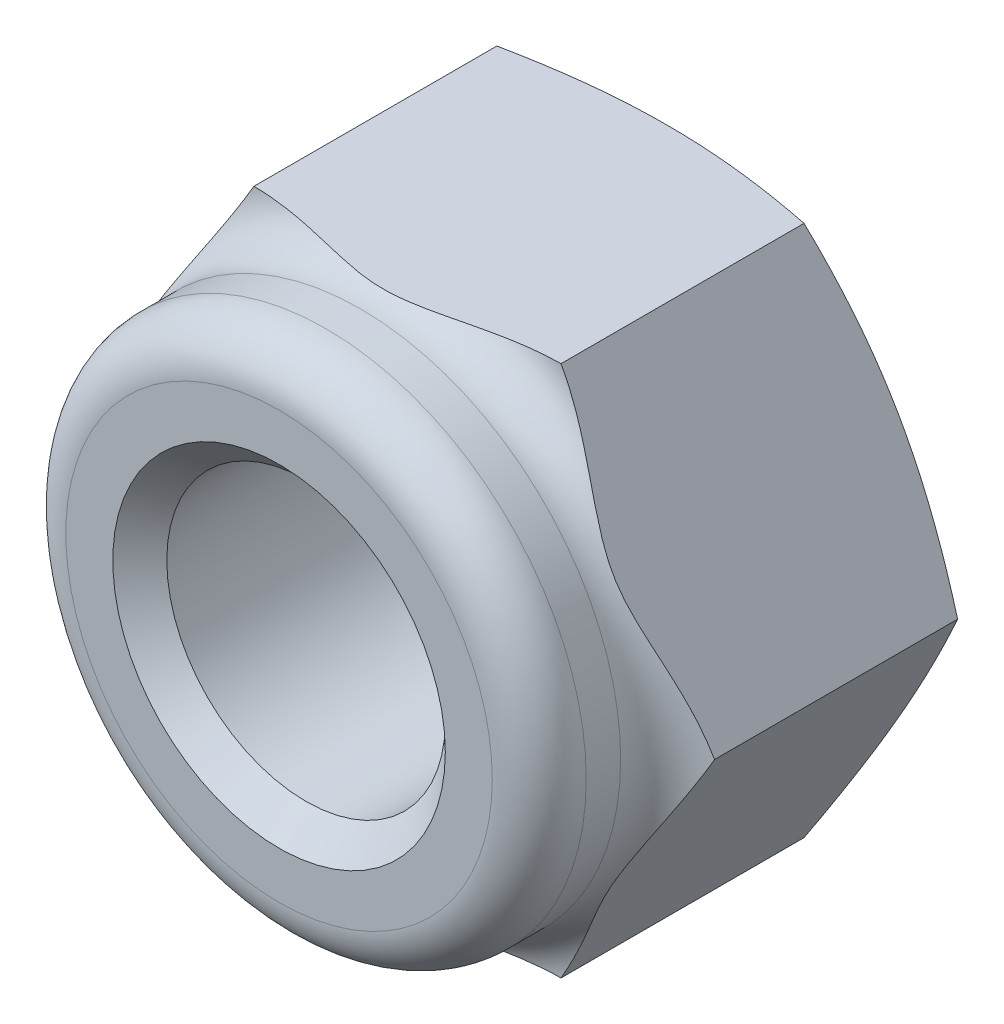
ISO-10303-21;
HEADER;
FILE_DESCRIPTION(('STEP AP214'),'2;1');
FILE_NAME('part.step','',(''),(''),'','','');
FILE_SCHEMA(('AUTOMOTIVE_DESIGN { 1 0 10303 214 1 1 1 1 }'));
ENDSEC;
DATA;
#1=APPLICATION_CONTEXT('core data for automotive mechanical design processes');
#2=APPLICATION_PROTOCOL_DEFINITION('international standard','automotive_design',2000,#1);
#3=PRODUCT_CONTEXT('',#1,'mechanical');
#4=PRODUCT('Part','Part','',(#3));
#5=PRODUCT_RELATED_PRODUCT_CATEGORY('part','',(#4));
#6=PRODUCT_DEFINITION_FORMATION('','',#4);
#7=PRODUCT_DEFINITION_CONTEXT('part definition',#1,'design');
#8=PRODUCT_DEFINITION('design','',#6,#7);
#9=PRODUCT_DEFINITION_SHAPE('','',#8);
#10=(LENGTH_UNIT() NAMED_UNIT(*) SI_UNIT(.MILLI.,.METRE.));
#11=(NAMED_UNIT(*) PLANE_ANGLE_UNIT() SI_UNIT($,.RADIAN.));
#12=(NAMED_UNIT(*) SI_UNIT($,.STERADIAN.) SOLID_ANGLE_UNIT());
#13=UNCERTAINTY_MEASURE_WITH_UNIT(LENGTH_MEASURE(1.E-05),#10,'distance_accuracy_value','');
#14=(GEOMETRIC_REPRESENTATION_CONTEXT(3) GLOBAL_UNCERTAINTY_ASSIGNED_CONTEXT((#13)) GLOBAL_UNIT_ASSIGNED_CONTEXT((#10,
#11,#12)) REPRESENTATION_CONTEXT('',''));
#15=CARTESIAN_POINT('',(0.,0.,0.));
#16=DIRECTION('',(0.,0.,1.));
#17=DIRECTION('',(1.,0.,0.));
#18=AXIS2_PLACEMENT_3D('',#15,#16,#17);
#19=CARTESIAN_POINT('',(0.,0.,9.45253333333));
#20=DIRECTION('',(0.,0.,1.));
#21=DIRECTION('',(0.,-1.,0.));
#22=AXIS2_PLACEMENT_3D('',#19,#20,#21);
#23=TOROIDAL_SURFACE('',#22,9.2376,1.41253333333);
#24=CARTESIAN_POINT('',(0.,0.,9.45253333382));
#25=DIRECTION('',(0.,0.,1.));
#26=DIRECTION('',(0.,-1.,0.));
#27=AXIS2_PLACEMENT_3D('',#24,#25,#26);
#28=CIRCLE('',#27,7.82506666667);
#29=CARTESIAN_POINT('',(0.,-7.82506666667,9.45253333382));
#30=VERTEX_POINT('',#29);
#31=EDGE_CURVE('E98',#30,#30,#28,.T.);
#32=ORIENTED_EDGE('',*,*,#31,.F.);
#33=EDGE_LOOP('',(#32));
#34=FACE_BOUND('',#33,.T.);
#35=CARTESIAN_POINT('',(-4.6187999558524,-7.99999634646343,8.04));
#36=CARTESIAN_POINT('',(-4.67179967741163,-7.90819813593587,8.04001844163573));
#37=CARTESIAN_POINT('',(-4.72477813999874,-7.81643674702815,8.04298143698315));
#38=CARTESIAN_POINT('',(-4.83056814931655,-7.63320307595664,8.05401318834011));
#39=CARTESIAN_POINT('',(-4.88337978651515,-7.54173063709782,8.06207839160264));
#40=CARTESIAN_POINT('',(-4.98833949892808,-7.35993508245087,8.08244681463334));
#41=CARTESIAN_POINT('',(-5.04048940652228,-7.26960879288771,8.09471357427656));
#42=CARTESIAN_POINT('',(-5.14455264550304,-7.08936597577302,8.12284015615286));
#43=CARTESIAN_POINT('',(-5.19646593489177,-6.9994495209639,8.13870059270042));
#44=CARTESIAN_POINT('',(-5.29837831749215,-6.82293209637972,8.17283355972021));
#45=CARTESIAN_POINT('',(-5.34838536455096,-6.73631735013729,8.19101231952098));
#46=CARTESIAN_POINT('',(-5.44818063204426,-6.56346687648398,8.22960775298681));
#47=CARTESIAN_POINT('',(-5.49796885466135,-6.47723114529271,8.25002440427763));
#48=CARTESIAN_POINT('',(-5.59766278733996,-6.30455618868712,8.29267772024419));
#49=CARTESIAN_POINT('',(-5.64756739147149,-6.21811887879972,8.3149246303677));
#50=CARTESIAN_POINT('',(-5.74723889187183,-6.04548277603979,8.36054287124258));
#51=CARTESIAN_POINT('',(-5.79700580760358,-5.95928394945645,8.38391403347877));
#52=CARTESIAN_POINT('',(-5.89158217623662,-5.79547287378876,8.42881094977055));
#53=CARTESIAN_POINT('',(-5.9363970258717,-5.71785127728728,8.45029168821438));
#54=CARTESIAN_POINT('',(-6.02604516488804,-5.56257614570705,8.49309828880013));
#55=CARTESIAN_POINT('',(-6.07087845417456,-5.48492261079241,8.51442415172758));
#56=CARTESIAN_POINT('',(-6.16068318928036,-5.32937624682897,8.55629756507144));
#57=CARTESIAN_POINT('',(-6.20565472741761,-5.25148325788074,8.57684433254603));
#58=CARTESIAN_POINT('',(-6.29577454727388,-5.09539115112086,8.61635815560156));
#59=CARTESIAN_POINT('',(-6.34092283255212,-5.01719202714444,8.63532517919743));
#60=CARTESIAN_POINT('',(-6.430916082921,-4.86131914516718,8.67052512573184));
#61=CARTESIAN_POINT('',(-6.47575799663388,-4.78365067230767,8.68678867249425));
#62=CARTESIAN_POINT('',(-6.56572904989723,-4.62781623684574,8.71582331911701));
#63=CARTESIAN_POINT('',(-6.61085817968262,-4.54965029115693,8.72859453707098));
#64=CARTESIAN_POINT('',(-6.70127512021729,-4.3930435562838,8.74956093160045));
#65=CARTESIAN_POINT('',(-6.74656225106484,-4.31460394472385,8.75776748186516));
#66=CARTESIAN_POINT('',(-6.83729960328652,-4.15744224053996,8.76881704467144));
#67=CARTESIAN_POINT('',(-6.88274980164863,-4.07872018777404,8.7716607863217));
#68=CARTESIAN_POINT('',(-6.97365019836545,-3.92127608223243,8.77166078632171));
#69=CARTESIAN_POINT('',(-7.01910039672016,-3.84255402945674,8.76881704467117));
#70=CARTESIAN_POINT('',(-7.10983774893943,-3.6853923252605,8.75776748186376));
#71=CARTESIAN_POINT('',(-7.15512487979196,-3.60695271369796,8.74956093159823));
#72=CARTESIAN_POINT('',(-7.24554182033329,-3.45034597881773,8.72859453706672));
#73=CARTESIAN_POINT('',(-7.29067095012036,-3.37218003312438,8.71582331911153));
#74=CARTESIAN_POINT('',(-7.38064200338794,-3.21634559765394,8.68678867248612));
#75=CARTESIAN_POINT('',(-7.42548391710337,-3.13867712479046,8.67052512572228));
#76=CARTESIAN_POINT('',(-7.51547716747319,-2.9828042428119,8.63532517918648));
#77=CARTESIAN_POINT('',(-7.56062545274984,-2.9046051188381,8.61635815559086));
#78=CARTESIAN_POINT('',(-7.65074527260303,-2.74851301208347,8.57684433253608));
#79=CARTESIAN_POINT('',(-7.69571681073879,-2.67062002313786,8.55629756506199));
#80=CARTESIAN_POINT('',(-7.78552154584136,-2.51507365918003,8.51442415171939));
#81=CARTESIAN_POINT('',(-7.83035483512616,-2.43742012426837,8.49309828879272));
#82=CARTESIAN_POINT('',(-7.92000297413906,-2.2821449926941,8.45029168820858));
#83=CARTESIAN_POINT('',(-7.96481782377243,-2.20452339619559,8.42881094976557));
#84=CARTESIAN_POINT('',(-8.05939419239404,-2.04071232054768,8.38391403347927));
#85=CARTESIAN_POINT('',(-8.10916110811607,-1.95451349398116,8.36054287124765));
#86=CARTESIAN_POINT('',(-8.20883260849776,-1.78187739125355,8.31492463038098));
#87=CARTESIAN_POINT('',(-8.25873721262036,-1.69544008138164,8.29267772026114));
#88=CARTESIAN_POINT('',(-8.35843114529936,-1.52276512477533,8.2500244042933));
#89=CARTESIAN_POINT('',(-8.40821936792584,-1.43652939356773,8.22960775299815));
#90=CARTESIAN_POINT('',(-8.50801463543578,-1.26367891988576,8.19101231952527));
#91=CARTESIAN_POINT('',(-8.55802168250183,-1.17706417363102,8.17283355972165));
#92=CARTESIAN_POINT('',(-8.65993405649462,-1.00054676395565,8.13870059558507));
#93=CARTESIAN_POINT('',(-8.71184733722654,-0.910630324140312,8.12284016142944));
#94=CARTESIAN_POINT('',(-8.81591055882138,-0.730387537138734,8.09471358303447));
#95=CARTESIAN_POINT('',(-8.86806045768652,-0.640061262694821,8.08244682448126));
#96=CARTESIAN_POINT('',(-8.9730201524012,-0.45826573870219,8.06207840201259));
#97=CARTESIAN_POINT('',(-9.02583178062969,-0.366793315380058,8.05401319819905));
#98=CARTESIAN_POINT('',(-9.13162177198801,-0.183559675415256,8.04298144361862));
#99=CARTESIAN_POINT('',(-9.18460022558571,-0.0917983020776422,8.04001844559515));
#100=CARTESIAN_POINT('',(-9.23759993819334,-1.0705474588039E-07,8.04));
#101=B_SPLINE_CURVE_WITH_KNOTS('',3,(#35,#36,#37,#38,#39,#40,#41,#42,#43,#44,#45,#46,#47,#48,
#49,#50,#51,#52,#53,#54,#55,#56,#57,#58,#59,#60,#61,#62,#63,#64,#65,#66,#67,#68,#69,#70,#71,#72,
#73,#74,#75,#76,#77,#78,#79,#80,#81,#82,#83,#84,#85,#86,#87,#88,#89,#90,#91,#92,#93,#94,#95,#96,
#97,#98,#99,#100),.UNSPECIFIED.,.F.,.F.,(4,2,2,2,2,2,2,2,2,2,2,2,2,2,2,2,2,2,2,2,2,2,2,2,2,2,2,
2,2,2,2,2,4),(0.,0.31789681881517,0.635572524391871,0.950558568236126,1.2655984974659,
1.57052567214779,1.87544979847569,2.18221516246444,2.48893468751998,2.76543839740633,
3.04194070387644,3.31871388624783,3.59549267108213,3.8688836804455,4.14226544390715,
4.4149629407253,4.68762335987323,4.96028377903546,5.23298127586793,5.50636303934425,
5.77975404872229,6.05653283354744,6.33330601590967,6.60980832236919,6.88631203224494,
7.19303155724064,7.49979692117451,7.8047210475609,8.10964822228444,8.42468809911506,
8.73967409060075,9.05734974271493,9.37524650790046),.UNSPECIFIED.);
#102=CARTESIAN_POINT('',(-4.61879991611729,-7.99999630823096,8.04));
#103=VERTEX_POINT('',#102);
#104=CARTESIAN_POINT('',(-9.23759999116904,-9.17566124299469E-08,8.04));
#105=VERTEX_POINT('',#104);
#106=EDGE_CURVE('E85',#103,#105,#101,.T.);
#107=ORIENTED_EDGE('',*,*,#106,.F.);
#108=CARTESIAN_POINT('',(4.61880008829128,-7.99999627,8.04));
#109=CARTESIAN_POINT('',(4.51280064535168,-7.99999626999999,8.04001844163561));
#110=CARTESIAN_POINT('',(4.40684372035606,-7.99999627,8.04298143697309));
#111=CARTESIAN_POINT('',(4.19526370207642,-7.99999627,8.05401318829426));
#112=CARTESIAN_POINT('',(4.08964042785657,-7.99999627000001,8.06207839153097));
#113=CARTESIAN_POINT('',(3.87972100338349,-7.99999626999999,8.08244681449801));
#114=CARTESIAN_POINT('',(3.77542118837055,-7.99999626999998,8.09471357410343));
#115=CARTESIAN_POINT('',(3.56729471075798,-7.99999627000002,8.12284015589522));
#116=CARTESIAN_POINT('',(3.46346813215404,-7.99999627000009,8.13870059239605));
#117=CARTESIAN_POINT('',(3.25964336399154,-7.99999627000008,8.17283355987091));
#118=CARTESIAN_POINT('',(3.15962926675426,-7.99999627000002,8.19101232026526));
#119=CARTESIAN_POINT('',(2.96003872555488,-7.99999626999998,8.22960775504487));
#120=CARTESIAN_POINT('',(2.86046227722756,-7.99999627,8.25002440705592));
#121=CARTESIAN_POINT('',(2.66107440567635,-7.99999627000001,8.29267772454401));
#122=CARTESIAN_POINT('',(2.56126519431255,-7.99999627,8.31492463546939));
#123=CARTESIAN_POINT('',(2.36192218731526,-7.99999627,8.36054287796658));
#124=CARTESIAN_POINT('',(2.26238835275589,-7.99999627,8.38391404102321));
#125=CARTESIAN_POINT('',(2.07323561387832,-7.99999627,8.4288109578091));
#126=CARTESIAN_POINT('',(1.98360591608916,-7.99999627,8.45029169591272));
#127=CARTESIAN_POINT('',(1.80430964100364,-7.99999627,8.49309829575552));
#128=CARTESIAN_POINT('',(1.71464306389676,-7.99999627,8.51442415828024));
#129=CARTESIAN_POINT('',(1.53503359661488,-7.99999627,8.55629757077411));
#130=CARTESIAN_POINT('',(1.44509052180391,-7.99999627,8.57684433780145));
#131=CARTESIAN_POINT('',(1.2648508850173,-7.99999627,8.61635815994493));
#132=CARTESIAN_POINT('',(1.1745543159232,-7.99999627,8.63532518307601));
#133=CARTESIAN_POINT('',(0.994567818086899,-7.99999627,8.67052512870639));
#134=CARTESIAN_POINT('',(0.904883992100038,-7.99999627,8.68678867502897));
#135=CARTESIAN_POINT('',(0.724941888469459,-7.99999627,8.71582332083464));
#136=CARTESIAN_POINT('',(0.634683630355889,-7.99999627,8.72859453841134));
#137=CARTESIAN_POINT('',(0.453849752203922,-7.99999627,8.7495609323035));
#138=CARTESIAN_POINT('',(0.363275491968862,-7.99999627,8.75776748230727));
#139=CARTESIAN_POINT('',(0.181800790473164,-7.99999627,8.76881704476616));
#140=CARTESIAN_POINT('',(0.0909003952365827,-7.99999627,8.77166078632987));
#141=CARTESIAN_POINT('',(-0.0909003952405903,-7.99999627,8.77166078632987));
#142=CARTESIAN_POINT('',(-0.181800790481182,-7.99999627,8.76881704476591));
#143=CARTESIAN_POINT('',(-0.363275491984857,-7.99999627,8.75776748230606));
#144=CARTESIAN_POINT('',(-0.453849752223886,-7.99999627,8.74956093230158));
#145=CARTESIAN_POINT('',(-0.634683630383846,-7.99999627,8.72859453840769));
#146=CARTESIAN_POINT('',(-0.724941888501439,-7.99999627,8.71582332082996));
#147=CARTESIAN_POINT('',(-0.904883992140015,-7.99999627,8.68678867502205));
#148=CARTESIAN_POINT('',(-0.994567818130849,-7.99999627,8.67052512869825));
#149=CARTESIAN_POINT('',(-1.17455431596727,-7.99999627,8.63532518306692));
#150=CARTESIAN_POINT('',(-1.26485088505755,-7.99999627,8.61635815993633));
#151=CARTESIAN_POINT('',(-1.44509052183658,-7.99999627,8.57684433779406));
#152=CARTESIAN_POINT('',(-1.53503359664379,-7.99999627,8.55629757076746));
#153=CARTESIAN_POINT('',(-1.71464306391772,-7.99999627,8.51442415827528));
#154=CARTESIAN_POINT('',(-1.8043096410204,-7.99999627,8.49309829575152));
#155=CARTESIAN_POINT('',(-1.98360591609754,-7.99999627,8.45029169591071));
#156=CARTESIAN_POINT('',(-2.07323561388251,-7.99999627,8.42881095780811));
#157=CARTESIAN_POINT('',(-2.26238835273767,-7.99999627,8.38391404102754));
#158=CARTESIAN_POINT('',(-2.36192218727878,-7.99999627,8.36054287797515));
#159=CARTESIAN_POINT('',(-2.56126519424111,-7.99999627,8.31492463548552));
#160=CARTESIAN_POINT('',(-2.66107440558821,-7.99999627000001,8.29267772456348));
#161=CARTESIAN_POINT('',(-2.86046227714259,-7.99999627,8.25002440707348));
#162=CARTESIAN_POINT('',(-2.96003872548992,-7.99999626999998,8.22960775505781));
#163=CARTESIAN_POINT('',(-3.15962926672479,-7.99999627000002,8.19101232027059));
#164=CARTESIAN_POINT('',(-3.25964336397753,-7.99999627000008,8.17283355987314));
#165=CARTESIAN_POINT('',(-3.46346811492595,-7.99999627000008,8.13870059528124));
#166=CARTESIAN_POINT('',(-3.5672946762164,-7.99999627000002,8.12284016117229));
#167=CARTESIAN_POINT('',(-3.77542111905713,-7.99999626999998,8.09471358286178));
#168=CARTESIAN_POINT('',(-3.87972091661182,-7.99999627,8.08244682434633));
#169=CARTESIAN_POINT('',(-4.08964030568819,-7.99999627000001,8.06207840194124));
#170=CARTESIAN_POINT('',(-4.19526356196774,-7.99999627,8.05401319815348));
#171=CARTESIAN_POINT('',(-4.40684354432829,-7.99999627,8.0429814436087));
#172=CARTESIAN_POINT('',(-4.51280045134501,-7.99999627,8.04001844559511));
#173=CARTESIAN_POINT('',(-4.61879987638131,-7.99999627,8.04));
#174=B_SPLINE_CURVE_WITH_KNOTS('',3,(#108,#109,#110,#111,#112,#113,#114,#115,#116,#117,#118,
#119,#120,#121,#122,#123,#124,#125,#126,#127,#128,#129,#130,#131,#132,#133,#134,#135,#136,#137,
#138,#139,#140,#141,#142,#143,#144,#145,#146,#147,#148,#149,#150,#151,#152,#153,#154,#155,#156,
#157,#158,#159,#160,#161,#162,#163,#164,#165,#166,#167,#168,#169,#170,#171,#172,#173),
.UNSPECIFIED.,.F.,.F.,(4,2,2,2,2,2,2,2,2,2,2,2,2,2,2,2,2,2,2,2,2,2,2,2,2,2,2,2,2,2,2,2,4),(0.,
0.317896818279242,0.635572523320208,0.950558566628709,1.2655984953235,1.57052567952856,
1.87544981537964,2.18221518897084,2.48893472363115,2.76543842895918,3.0419407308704,
3.31871390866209,3.59549268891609,3.86888369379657,4.14226545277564,4.41496294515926,
4.687623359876,4.96028377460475,5.23298126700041,5.50636302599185,5.77975403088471,
6.05653281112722,6.33330598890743,6.60980829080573,6.88631199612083,7.19303153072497,
7.49979690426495,7.80472104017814,8.10964822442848,8.4246881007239,8.73967409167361,
9.05734974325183,9.37524650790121),.UNSPECIFIED.);
#175=CARTESIAN_POINT('',(4.61880007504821,-7.99999621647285,8.04));
#176=VERTEX_POINT('',#175);
#177=EDGE_CURVE('E79',#176,#103,#174,.T.);
#178=ORIENTED_EDGE('',*,*,#177,.F.);
#179=CARTESIAN_POINT('',(9.23760004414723,7.64627748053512E-08,8.04));
#180=CARTESIAN_POINT('',(9.18460032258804,-0.0917981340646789,8.0400184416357));
#181=CARTESIAN_POINT('',(9.13162186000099,-0.183559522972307,8.04298143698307));
#182=CARTESIAN_POINT('',(9.0258318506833,-0.366793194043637,8.05401318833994));
#183=CARTESIAN_POINT('',(8.97302021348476,-0.458265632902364,8.06207839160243));
#184=CARTESIAN_POINT('',(8.86806050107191,-0.64006118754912,8.08244681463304));
#185=CARTESIAN_POINT('',(8.81591059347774,-0.730387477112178,8.09471357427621));
#186=CARTESIAN_POINT('',(8.71184735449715,-0.910630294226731,8.12284015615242));
#187=CARTESIAN_POINT('',(8.65993406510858,-1.00054674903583,8.13870059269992));
#188=CARTESIAN_POINT('',(8.55802168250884,-1.17706417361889,8.17283355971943));
#189=CARTESIAN_POINT('',(8.50801463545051,-1.26367891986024,8.19101231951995));
#190=CARTESIAN_POINT('',(8.40821936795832,-1.43652939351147,8.22960775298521));
#191=CARTESIAN_POINT('',(8.35843114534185,-1.52276512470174,8.25002440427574));
#192=CARTESIAN_POINT('',(8.25873721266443,-1.6954400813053,8.29267772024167));
#193=CARTESIAN_POINT('',(8.20883260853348,-1.78187739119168,8.31492463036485));
#194=CARTESIAN_POINT('',(8.10916110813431,-1.95451349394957,8.36054287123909));
#195=CARTESIAN_POINT('',(8.05939419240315,-2.04071232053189,8.38391403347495));
#196=CARTESIAN_POINT('',(7.96481782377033,-2.20452339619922,8.42881094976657));
#197=CARTESIAN_POINT('',(7.92000297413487,-2.28214499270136,8.45029168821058));
#198=CARTESIAN_POINT('',(7.83035483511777,-2.43742012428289,8.49309828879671));
#199=CARTESIAN_POINT('',(7.78552154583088,-2.51507365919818,8.51442415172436));
#200=CARTESIAN_POINT('',(7.69571681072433,-2.6706200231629,8.55629756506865));
#201=CARTESIAN_POINT('',(7.65074527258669,-2.74851301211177,8.57684433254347));
#202=CARTESIAN_POINT('',(7.56062545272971,-2.90460511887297,8.61635815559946));
#203=CARTESIAN_POINT('',(7.51547716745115,-2.98280424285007,8.63532517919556));
#204=CARTESIAN_POINT('',(7.42548391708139,-3.13867712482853,8.67052512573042));
#205=CARTESIAN_POINT('',(7.38064200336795,-3.21634559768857,8.68678867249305));
#206=CARTESIAN_POINT('',(7.29067095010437,-3.37218003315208,8.71582331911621));
#207=CARTESIAN_POINT('',(7.24554182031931,-3.45034597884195,8.72859453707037));
#208=CARTESIAN_POINT('',(7.15512487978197,-3.60695271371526,8.74956093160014));
#209=CARTESIAN_POINT('',(7.10983774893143,-3.68539232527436,8.75776748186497));
#210=CARTESIAN_POINT('',(7.01910039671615,-3.84255402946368,8.76881704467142));
#211=CARTESIAN_POINT('',(6.97365019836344,-3.9212760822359,8.77166078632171));
#212=CARTESIAN_POINT('',(6.88274980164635,-4.07872018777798,8.7716607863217));
#213=CARTESIAN_POINT('',(6.83729960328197,-4.15744224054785,8.76881704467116));
#214=CARTESIAN_POINT('',(6.74656225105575,-4.31460394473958,8.75776748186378));
#215=CARTESIAN_POINT('',(6.70127512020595,-4.39304355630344,8.74956093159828));
#216=CARTESIAN_POINT('',(6.61085817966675,-4.54965029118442,8.72859453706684));
#217=CARTESIAN_POINT('',(6.56572904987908,-4.62781623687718,8.71582331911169));
#218=CARTESIAN_POINT('',(6.4757579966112,-4.78365067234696,8.68678867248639));
#219=CARTESIAN_POINT('',(6.43091608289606,-4.86131914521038,8.6705251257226));
#220=CARTESIAN_POINT('',(6.34092283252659,-5.01719202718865,8.63532517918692));
#221=CARTESIAN_POINT('',(6.29577454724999,-5.09539115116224,8.61635815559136));
#222=CARTESIAN_POINT('',(6.20565472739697,-5.25148325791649,8.57684433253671));
#223=CARTESIAN_POINT('',(6.16068318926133,-5.32937624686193,8.55629756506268));
#224=CARTESIAN_POINT('',(6.07087845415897,-5.4849226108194,8.5144241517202));
#225=CARTESIAN_POINT('',(6.02604516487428,-5.56257614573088,8.49309828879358));
#226=CARTESIAN_POINT('',(5.93639702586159,-5.71785127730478,8.45029168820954));
#227=CARTESIAN_POINT('',(5.89158217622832,-5.79547287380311,8.42881094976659));
#228=CARTESIAN_POINT('',(5.79700580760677,-5.95928394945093,8.3839140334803));
#229=CARTESIAN_POINT('',(5.74723889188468,-6.04548277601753,8.36054287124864));
#230=CARTESIAN_POINT('',(5.6475673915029,-6.21811887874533,8.3149246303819));
#231=CARTESIAN_POINT('',(5.59766278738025,-6.30455618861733,8.29267772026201));
#232=CARTESIAN_POINT('',(5.49796885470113,-6.4772311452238,8.25002440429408));
#233=CARTESIAN_POINT('',(5.44818063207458,-6.56346687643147,8.22960775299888));
#234=CARTESIAN_POINT('',(5.34838536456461,-6.73631735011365,8.19101231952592));
#235=CARTESIAN_POINT('',(5.29837831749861,-6.82293209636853,8.17283355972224));
#236=CARTESIAN_POINT('',(5.19646594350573,-6.99944950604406,8.13870059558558));
#237=CARTESIAN_POINT('',(5.14455266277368,-7.08936594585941,8.12284016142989));
#238=CARTESIAN_POINT('',(5.04048944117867,-7.26960873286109,8.09471358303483));
#239=CARTESIAN_POINT('',(4.98833954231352,-7.35993500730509,8.08244682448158));
#240=CARTESIAN_POINT('',(4.88337984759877,-7.54173053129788,8.06207840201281));
#241=CARTESIAN_POINT('',(4.83056821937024,-7.63320295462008,8.05401319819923));
#242=CARTESIAN_POINT('',(4.72477822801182,-7.81643659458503,8.0429814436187));
#243=CARTESIAN_POINT('',(4.67179977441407,-7.90819796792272,8.04001844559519));
#244=CARTESIAN_POINT('',(4.61880006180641,-7.9999961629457,8.04));
#245=B_SPLINE_CURVE_WITH_KNOTS('',3,(#179,#180,#181,#182,#183,#184,#185,#186,#187,#188,#189,
#190,#191,#192,#193,#194,#195,#196,#197,#198,#199,#200,#201,#202,#203,#204,#205,#206,#207,#208,
#209,#210,#211,#212,#213,#214,#215,#216,#217,#218,#219,#220,#221,#222,#223,#224,#225,#226,#227,
#228,#229,#230,#231,#232,#233,#234,#235,#236,#237,#238,#239,#240,#241,#242,#243,#244),
.UNSPECIFIED.,.F.,.F.,(4,2,2,2,2,2,2,2,2,2,2,2,2,2,2,2,2,2,2,2,2,2,2,2,2,2,2,2,2,2,2,2,4),(0.,
0.317896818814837,0.635572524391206,0.950558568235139,1.26559849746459,1.57052567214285,
1.87544979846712,2.18221516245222,2.48893468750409,2.76543839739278,3.04194070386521,
3.31871388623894,3.59549267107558,3.86888368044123,4.14226544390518,4.41496294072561,
4.68762335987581,4.9602837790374,5.23298127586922,5.5063630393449,5.77975404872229,
6.05653283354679,6.33330601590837,6.60980832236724,6.88631203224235,7.19303155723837,
7.49979692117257,7.80472104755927,8.10964822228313,8.42468809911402,8.73967409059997,
9.05734974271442,9.37524650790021),.UNSPECIFIED.);
#246=CARTESIAN_POINT('',(9.23759998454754,1.03229682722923E-07,8.04));
#247=VERTEX_POINT('',#246);
#248=EDGE_CURVE('E82',#247,#176,#245,.T.);
#249=ORIENTED_EDGE('',*,*,#248,.F.);
#250=CARTESIAN_POINT('',(4.6187999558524,7.99999634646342,8.04));
#251=CARTESIAN_POINT('',(4.67179967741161,7.90819813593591,8.04001844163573));
#252=CARTESIAN_POINT('',(4.7247781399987,7.81643674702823,8.04298143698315));
#253=CARTESIAN_POINT('',(4.83056814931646,7.63320307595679,8.05401318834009));
#254=CARTESIAN_POINT('',(4.88337978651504,7.54173063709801,8.06207839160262));
#255=CARTESIAN_POINT('',(4.98833949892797,7.35993508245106,8.08244681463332));
#256=CARTESIAN_POINT('',(5.04048940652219,7.26960879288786,8.09471357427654));
#257=CARTESIAN_POINT('',(5.144552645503,7.0893659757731,8.12284015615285));
#258=CARTESIAN_POINT('',(5.19646593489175,6.99944952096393,8.13870059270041));
#259=CARTESIAN_POINT('',(5.29837831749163,6.82293209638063,8.17283355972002));
#260=CARTESIAN_POINT('',(5.34838536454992,6.7363173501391,8.1910123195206));
#261=CARTESIAN_POINT('',(5.44818063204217,6.5634668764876,8.22960775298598));
#262=CARTESIAN_POINT('',(5.49796885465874,6.47723114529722,8.25002440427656));
#263=CARTESIAN_POINT('',(5.59766278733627,6.30455618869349,8.29267772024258));
#264=CARTESIAN_POINT('',(5.64756739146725,6.21811887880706,8.3149246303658));
#265=CARTESIAN_POINT('',(5.74723889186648,6.04548277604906,8.36054287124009));
#266=CARTESIAN_POINT('',(5.79700580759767,5.95928394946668,8.38391403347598));
#267=CARTESIAN_POINT('',(5.89158217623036,5.79547287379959,8.42881094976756));
#268=CARTESIAN_POINT('',(5.93639702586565,5.71785127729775,8.45029168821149));
#269=CARTESIAN_POINT('',(6.02604516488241,5.5625761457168,8.49309828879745));
#270=CARTESIAN_POINT('',(6.07087845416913,5.48492261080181,8.51442415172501));
#271=CARTESIAN_POINT('',(6.16068318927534,5.32937624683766,8.55629756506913));
#272=CARTESIAN_POINT('',(6.2056547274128,5.25148325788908,8.57684433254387));
#273=CARTESIAN_POINT('',(6.29577454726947,5.09539115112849,8.61635815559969));
#274=CARTESIAN_POINT('',(6.34092283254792,5.01719202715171,8.63532517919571));
#275=CARTESIAN_POINT('',(6.43091608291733,4.86131914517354,8.67052512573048));
#276=CARTESIAN_POINT('',(6.47575799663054,4.78365067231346,8.68678867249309));
#277=CARTESIAN_POINT('',(6.56572904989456,4.62781623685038,8.71582331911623));
#278=CARTESIAN_POINT('',(6.61085817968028,4.54965029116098,8.72859453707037));
#279=CARTESIAN_POINT('',(6.70127512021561,4.39304355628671,8.74956093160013));
#280=CARTESIAN_POINT('',(6.7465622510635,4.31460394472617,8.75776748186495));
#281=CARTESIAN_POINT('',(6.83729960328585,4.15744224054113,8.7688170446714));
#282=CARTESIAN_POINT('',(6.88274980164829,4.07872018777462,8.7716607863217));
#283=CARTESIAN_POINT('',(6.97365019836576,3.92127608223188,8.77166078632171));
#284=CARTESIAN_POINT('',(7.01910039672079,3.84255402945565,8.76881704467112));
#285=CARTESIAN_POINT('',(7.10983774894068,3.68539232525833,8.75776748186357));
#286=CARTESIAN_POINT('',(7.15512487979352,3.60695271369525,8.74956093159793));
#287=CARTESIAN_POINT('',(7.24554182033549,3.45034597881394,8.72859453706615));
#288=CARTESIAN_POINT('',(7.29067095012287,3.37218003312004,8.71582331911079));
#289=CARTESIAN_POINT('',(7.38064200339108,3.21634559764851,8.68678867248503));
#290=CARTESIAN_POINT('',(7.42548391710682,3.13867712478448,8.670525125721));
#291=CARTESIAN_POINT('',(7.51547716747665,2.98280424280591,8.63532517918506));
#292=CARTESIAN_POINT('',(7.560625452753,2.90460511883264,8.61635815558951));
#293=CARTESIAN_POINT('',(7.65074527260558,2.74851301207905,8.57684433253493));
#294=CARTESIAN_POINT('',(7.69571681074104,2.67062002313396,8.55629756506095));
#295=CARTESIAN_POINT('',(7.78552154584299,2.51507365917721,8.51442415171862));
#296=CARTESIAN_POINT('',(7.83035483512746,2.43742012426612,8.4930982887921));
#297=CARTESIAN_POINT('',(7.92000297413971,2.28214499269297,8.45029168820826));
#298=CARTESIAN_POINT('',(7.96481782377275,2.20452339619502,8.42881094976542));
#299=CARTESIAN_POINT('',(8.05939419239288,2.04071232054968,8.38391403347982));
#300=CARTESIAN_POINT('',(8.10916110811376,1.95451349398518,8.36054287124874));
#301=CARTESIAN_POINT('',(8.20883260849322,1.78187739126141,8.31492463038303));
#302=CARTESIAN_POINT('',(8.25873721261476,1.69544008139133,8.29267772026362));
#303=CARTESIAN_POINT('',(8.35843114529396,1.52276512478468,8.25002440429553));
#304=CARTESIAN_POINT('',(8.40821936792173,1.4365293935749,8.22960775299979));
#305=CARTESIAN_POINT('',(8.50801463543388,1.263678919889,8.19101231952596));
#306=CARTESIAN_POINT('',(8.55802168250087,1.17706417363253,8.17283355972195));
#307=CARTESIAN_POINT('',(8.65993405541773,1.00054676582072,8.13870059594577));
#308=CARTESIAN_POINT('',(8.71184733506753,0.910630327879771,8.12284016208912));
#309=CARTESIAN_POINT('',(8.81591055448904,0.730387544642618,8.09471358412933));
#310=CARTESIAN_POINT('',(8.86806045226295,0.640061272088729,8.08244682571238));
#311=CARTESIAN_POINT('',(8.97302014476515,0.458265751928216,8.06207840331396));
#312=CARTESIAN_POINT('',(9.02583177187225,0.36679333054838,8.05401319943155));
#313=CARTESIAN_POINT('',(9.1316217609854,0.183559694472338,8.04298144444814));
#314=CARTESIAN_POINT('',(9.18460021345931,0.0917983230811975,8.04001844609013));
#315=CARTESIAN_POINT('',(9.23759992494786,1.29996586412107E-07,8.04));
#316=B_SPLINE_CURVE_WITH_KNOTS('',3,(#250,#251,#252,#253,#254,#255,#256,#257,#258,#259,#260,
#261,#262,#263,#264,#265,#266,#267,#268,#269,#270,#271,#272,#273,#274,#275,#276,#277,#278,#279,
#280,#281,#282,#283,#284,#285,#286,#287,#288,#289,#290,#291,#292,#293,#294,#295,#296,#297,#298,
#299,#300,#301,#302,#303,#304,#305,#306,#307,#308,#309,#310,#311,#312,#313,#314,#315),
.UNSPECIFIED.,.F.,.F.,(4,2,2,2,2,2,2,2,2,2,2,2,2,2,2,2,2,2,2,2,2,2,2,2,2,2,2,2,2,2,2,2,4),(0.,
0.317896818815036,0.635572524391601,0.950558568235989,1.2655984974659,1.57052567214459,
1.87544979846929,2.1822151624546,2.48893468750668,2.76543839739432,3.04194070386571,
3.31871388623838,3.59549267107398,3.8688836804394,4.1422654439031,4.41496294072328,
4.68762335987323,4.96028377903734,5.23298127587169,5.50636303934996,5.77975404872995,
6.05653283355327,6.33330601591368,6.60980832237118,6.88631203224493,7.19303155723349,
7.49979692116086,7.80472104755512,8.10964822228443,8.42468809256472,8.73967407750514,
9.05734972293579,9.37524648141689),.UNSPECIFIED.);
#317=CARTESIAN_POINT('',(4.61879991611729,7.99999630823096,8.04));
#318=VERTEX_POINT('',#317);
#319=EDGE_CURVE('E127',#318,#247,#316,.T.);
#320=ORIENTED_EDGE('',*,*,#319,.F.);
#321=CARTESIAN_POINT('',(-4.61880008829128,7.99999627,8.04));
#322=CARTESIAN_POINT('',(-4.51280064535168,7.99999626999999,8.04001844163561));
#323=CARTESIAN_POINT('',(-4.40684372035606,7.99999627,8.04298143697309));
#324=CARTESIAN_POINT('',(-4.19526370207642,7.99999627,8.05401318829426));
#325=CARTESIAN_POINT('',(-4.08964042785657,7.99999627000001,8.06207839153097));
#326=CARTESIAN_POINT('',(-3.87972100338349,7.99999626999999,8.08244681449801));
#327=CARTESIAN_POINT('',(-3.77542118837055,7.99999626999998,8.09471357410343));
#328=CARTESIAN_POINT('',(-3.56729471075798,7.99999627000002,8.12284015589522));
#329=CARTESIAN_POINT('',(-3.46346813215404,7.99999627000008,8.13870059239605));
#330=CARTESIAN_POINT('',(-3.25964336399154,7.99999627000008,8.17283355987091));
#331=CARTESIAN_POINT('',(-3.15962926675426,7.99999627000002,8.19101232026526));
#332=CARTESIAN_POINT('',(-2.96003872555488,7.99999626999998,8.22960775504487));
#333=CARTESIAN_POINT('',(-2.86046227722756,7.99999627,8.25002440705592));
#334=CARTESIAN_POINT('',(-2.66107440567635,7.99999627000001,8.29267772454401));
#335=CARTESIAN_POINT('',(-2.56126519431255,7.99999627,8.31492463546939));
#336=CARTESIAN_POINT('',(-2.36192218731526,7.99999627,8.36054287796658));
#337=CARTESIAN_POINT('',(-2.26238835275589,7.99999627,8.38391404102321));
#338=CARTESIAN_POINT('',(-2.07323561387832,7.99999627,8.4288109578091));
#339=CARTESIAN_POINT('',(-1.98360591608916,7.99999627,8.45029169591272));
#340=CARTESIAN_POINT('',(-1.80430964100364,7.99999627,8.49309829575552));
#341=CARTESIAN_POINT('',(-1.71464306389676,7.99999627,8.51442415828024));
#342=CARTESIAN_POINT('',(-1.53503359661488,7.99999627,8.55629757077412));
#343=CARTESIAN_POINT('',(-1.44509052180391,7.99999627,8.57684433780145));
#344=CARTESIAN_POINT('',(-1.2648508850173,7.99999627,8.61635815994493));
#345=CARTESIAN_POINT('',(-1.1745543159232,7.99999627,8.63532518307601));
#346=CARTESIAN_POINT('',(-0.994567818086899,7.99999627,8.67052512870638));
#347=CARTESIAN_POINT('',(-0.904883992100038,7.99999627,8.68678867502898));
#348=CARTESIAN_POINT('',(-0.724941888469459,7.99999627,8.71582332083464));
#349=CARTESIAN_POINT('',(-0.634683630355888,7.99999627,8.72859453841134));
#350=CARTESIAN_POINT('',(-0.453849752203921,7.99999627,8.7495609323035));
#351=CARTESIAN_POINT('',(-0.363275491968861,7.99999627,8.75776748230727));
#352=CARTESIAN_POINT('',(-0.181800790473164,7.99999627,8.76881704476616));
#353=CARTESIAN_POINT('',(-0.0909003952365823,7.99999627,8.77166078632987));
#354=CARTESIAN_POINT('',(0.0909003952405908,7.99999627,8.77166078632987));
#355=CARTESIAN_POINT('',(0.181800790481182,7.99999627,8.76881704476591));
#356=CARTESIAN_POINT('',(0.363275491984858,7.99999627,8.75776748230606));
#357=CARTESIAN_POINT('',(0.453849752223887,7.99999627,8.74956093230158));
#358=CARTESIAN_POINT('',(0.634683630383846,7.99999627,8.72859453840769));
#359=CARTESIAN_POINT('',(0.724941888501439,7.99999627,8.71582332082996));
#360=CARTESIAN_POINT('',(0.904883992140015,7.99999627,8.68678867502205));
#361=CARTESIAN_POINT('',(0.994567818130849,7.99999627,8.67052512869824));
#362=CARTESIAN_POINT('',(1.17455431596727,7.99999627,8.63532518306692));
#363=CARTESIAN_POINT('',(1.26485088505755,7.99999627,8.61635815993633));
#364=CARTESIAN_POINT('',(1.44509052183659,7.99999627,8.57684433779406));
#365=CARTESIAN_POINT('',(1.53503359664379,7.99999627,8.55629757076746));
#366=CARTESIAN_POINT('',(1.71464306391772,7.99999627,8.51442415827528));
#367=CARTESIAN_POINT('',(1.8043096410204,7.99999627,8.49309829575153));
#368=CARTESIAN_POINT('',(1.98360591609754,7.99999627,8.45029169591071));
#369=CARTESIAN_POINT('',(2.07323561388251,7.99999627,8.42881095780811));
#370=CARTESIAN_POINT('',(2.26238835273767,7.99999627,8.38391404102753));
#371=CARTESIAN_POINT('',(2.36192218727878,7.99999627,8.36054287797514));
#372=CARTESIAN_POINT('',(2.56126519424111,7.99999627,8.31492463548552));
#373=CARTESIAN_POINT('',(2.66107440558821,7.99999627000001,8.29267772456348));
#374=CARTESIAN_POINT('',(2.8604622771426,7.99999627,8.25002440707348));
#375=CARTESIAN_POINT('',(2.96003872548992,7.99999626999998,8.22960775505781));
#376=CARTESIAN_POINT('',(3.15962926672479,7.99999627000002,8.19101232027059));
#377=CARTESIAN_POINT('',(3.25964336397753,7.99999627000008,8.17283355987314));
#378=CARTESIAN_POINT('',(3.46346811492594,7.99999627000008,8.13870059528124));
#379=CARTESIAN_POINT('',(3.56729467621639,7.99999627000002,8.12284016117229));
#380=CARTESIAN_POINT('',(3.77542111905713,7.99999626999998,8.09471358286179));
#381=CARTESIAN_POINT('',(3.87972091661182,7.99999626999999,8.08244682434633));
#382=CARTESIAN_POINT('',(4.08964030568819,7.99999627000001,8.06207840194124));
#383=CARTESIAN_POINT('',(4.19526356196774,7.99999627,8.05401319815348));
#384=CARTESIAN_POINT('',(4.40684354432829,7.99999627,8.0429814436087));
#385=CARTESIAN_POINT('',(4.51280045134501,7.99999626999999,8.04001844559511));
#386=CARTESIAN_POINT('',(4.61879987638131,7.99999627,8.04));
#387=B_SPLINE_CURVE_WITH_KNOTS('',3,(#321,#322,#323,#324,#325,#326,#327,#328,#329,#330,#331,
#332,#333,#334,#335,#336,#337,#338,#339,#340,#341,#342,#343,#344,#345,#346,#347,#348,#349,#350,
#351,#352,#353,#354,#355,#356,#357,#358,#359,#360,#361,#362,#363,#364,#365,#366,#367,#368,#369,
#370,#371,#372,#373,#374,#375,#376,#377,#378,#379,#380,#381,#382,#383,#384,#385,#386),
.UNSPECIFIED.,.F.,.F.,(4,2,2,2,2,2,2,2,2,2,2,2,2,2,2,2,2,2,2,2,2,2,2,2,2,2,2,2,2,2,2,2,4),(0.,
0.317896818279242,0.635572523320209,0.950558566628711,1.2655984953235,1.57052567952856,
1.87544981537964,2.18221518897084,2.48893472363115,2.76543842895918,3.0419407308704,
3.31871390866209,3.59549268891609,3.86888369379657,4.14226545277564,4.41496294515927,
4.687623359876,4.96028377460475,5.23298126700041,5.50636302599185,5.77975403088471,
6.05653281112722,6.33330598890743,6.60980829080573,6.88631199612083,7.19303153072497,
7.49979690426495,7.80472104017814,8.10964822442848,8.4246881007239,8.73967409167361,
9.05734974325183,9.37524650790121),.UNSPECIFIED.);
#388=CARTESIAN_POINT('',(-4.61880007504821,7.99999621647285,8.04));
#389=VERTEX_POINT('',#388);
#390=EDGE_CURVE('E135',#389,#318,#387,.T.);
#391=ORIENTED_EDGE('',*,*,#390,.F.);
#392=CARTESIAN_POINT('',(-9.23760004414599,-7.64606244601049E-08,8.04));
#393=CARTESIAN_POINT('',(-9.1846003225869,0.0917981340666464,8.04001844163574));
#394=CARTESIAN_POINT('',(-9.13162185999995,0.183559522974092,8.04298143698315));
#395=CARTESIAN_POINT('',(-9.02583185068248,0.366793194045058,8.05401318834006));
#396=CARTESIAN_POINT('',(-8.97302021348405,0.458265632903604,8.06207839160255));
#397=CARTESIAN_POINT('',(-8.8680605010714,0.64006118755,8.08244681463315));
#398=CARTESIAN_POINT('',(-8.81591059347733,0.730387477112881,8.09471357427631));
#399=CARTESIAN_POINT('',(-8.71184735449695,0.91063029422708,8.12284015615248));
#400=CARTESIAN_POINT('',(-8.65993406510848,1.00054674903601,8.13870059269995));
#401=CARTESIAN_POINT('',(-8.55802168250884,1.17706417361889,8.17283355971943));
#402=CARTESIAN_POINT('',(-8.50801463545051,1.26367891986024,8.19101231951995));
#403=CARTESIAN_POINT('',(-8.40821936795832,1.43652939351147,8.22960775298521));
#404=CARTESIAN_POINT('',(-8.35843114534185,1.52276512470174,8.25002440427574));
#405=CARTESIAN_POINT('',(-8.25873721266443,1.69544008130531,8.29267772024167));
#406=CARTESIAN_POINT('',(-8.20883260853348,1.78187739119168,8.31492463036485));
#407=CARTESIAN_POINT('',(-8.10916110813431,1.95451349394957,8.36054287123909));
#408=CARTESIAN_POINT('',(-8.05939419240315,2.04071232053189,8.38391403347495));
#409=CARTESIAN_POINT('',(-7.96481782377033,2.20452339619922,8.42881094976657));
#410=CARTESIAN_POINT('',(-7.92000297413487,2.28214499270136,8.45029168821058));
#411=CARTESIAN_POINT('',(-7.83035483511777,2.43742012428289,8.49309828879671));
#412=CARTESIAN_POINT('',(-7.78552154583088,2.51507365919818,8.51442415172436));
#413=CARTESIAN_POINT('',(-7.69571681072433,2.6706200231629,8.55629756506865));
#414=CARTESIAN_POINT('',(-7.65074527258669,2.74851301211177,8.57684433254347));
#415=CARTESIAN_POINT('',(-7.56062545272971,2.90460511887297,8.61635815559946));
#416=CARTESIAN_POINT('',(-7.51547716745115,2.98280424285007,8.63532517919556));
#417=CARTESIAN_POINT('',(-7.42548391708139,3.13867712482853,8.67052512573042));
#418=CARTESIAN_POINT('',(-7.38064200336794,3.21634559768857,8.68678867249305));
#419=CARTESIAN_POINT('',(-7.29067095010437,3.37218003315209,8.71582331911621));
#420=CARTESIAN_POINT('',(-7.24554182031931,3.45034597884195,8.72859453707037));
#421=CARTESIAN_POINT('',(-7.15512487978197,3.60695271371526,8.74956093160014));
#422=CARTESIAN_POINT('',(-7.10983774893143,3.68539232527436,8.75776748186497));
#423=CARTESIAN_POINT('',(-7.01910039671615,3.84255402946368,8.76881704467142));
#424=CARTESIAN_POINT('',(-6.97365019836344,3.9212760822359,8.77166078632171));
#425=CARTESIAN_POINT('',(-6.88274980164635,4.07872018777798,8.7716607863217));
#426=CARTESIAN_POINT('',(-6.83729960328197,4.15744224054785,8.76881704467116));
#427=CARTESIAN_POINT('',(-6.74656225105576,4.31460394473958,8.75776748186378));
#428=CARTESIAN_POINT('',(-6.70127512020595,4.39304355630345,8.74956093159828));
#429=CARTESIAN_POINT('',(-6.61085817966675,4.54965029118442,8.72859453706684));
#430=CARTESIAN_POINT('',(-6.56572904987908,4.62781623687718,8.71582331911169));
#431=CARTESIAN_POINT('',(-6.4757579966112,4.78365067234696,8.68678867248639));
#432=CARTESIAN_POINT('',(-6.43091608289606,4.86131914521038,8.67052512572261));
#433=CARTESIAN_POINT('',(-6.34092283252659,5.01719202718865,8.63532517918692));
#434=CARTESIAN_POINT('',(-6.29577454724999,5.09539115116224,8.61635815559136));
#435=CARTESIAN_POINT('',(-6.20565472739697,5.25148325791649,8.57684433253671));
#436=CARTESIAN_POINT('',(-6.16068318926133,5.32937624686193,8.55629756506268));
#437=CARTESIAN_POINT('',(-6.07087845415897,5.4849226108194,8.5144241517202));
#438=CARTESIAN_POINT('',(-6.02604516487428,5.56257614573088,8.49309828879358));
#439=CARTESIAN_POINT('',(-5.93639702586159,5.71785127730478,8.45029168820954));
#440=CARTESIAN_POINT('',(-5.89158217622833,5.79547287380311,8.42881094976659));
#441=CARTESIAN_POINT('',(-5.79700580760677,5.95928394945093,8.3839140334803));
#442=CARTESIAN_POINT('',(-5.74723889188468,6.04548277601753,8.36054287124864));
#443=CARTESIAN_POINT('',(-5.6475673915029,6.21811887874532,8.3149246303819));
#444=CARTESIAN_POINT('',(-5.59766278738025,6.30455618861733,8.29267772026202));
#445=CARTESIAN_POINT('',(-5.49796885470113,6.4772311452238,8.25002440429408));
#446=CARTESIAN_POINT('',(-5.44818063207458,6.56346687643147,8.22960775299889));
#447=CARTESIAN_POINT('',(-5.34838536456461,6.73631735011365,8.19101231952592));
#448=CARTESIAN_POINT('',(-5.29837831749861,6.82293209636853,8.17283355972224));
#449=CARTESIAN_POINT('',(-5.19646594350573,6.99944950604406,8.13870059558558));
#450=CARTESIAN_POINT('',(-5.14455266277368,7.08936594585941,8.12284016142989));
#451=CARTESIAN_POINT('',(-5.04048944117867,7.26960873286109,8.09471358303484));
#452=CARTESIAN_POINT('',(-4.98833954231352,7.35993500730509,8.08244682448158));
#453=CARTESIAN_POINT('',(-4.88337984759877,7.54173053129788,8.06207840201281));
#454=CARTESIAN_POINT('',(-4.83056821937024,7.63320295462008,8.05401319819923));
#455=CARTESIAN_POINT('',(-4.72477822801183,7.81643659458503,8.04298144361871));
#456=CARTESIAN_POINT('',(-4.67179977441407,7.90819796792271,8.04001844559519));
#457=CARTESIAN_POINT('',(-4.61880006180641,7.99999616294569,8.04));
#458=B_SPLINE_CURVE_WITH_KNOTS('',3,(#392,#393,#394,#395,#396,#397,#398,#399,#400,#401,#402,
#403,#404,#405,#406,#407,#408,#409,#410,#411,#412,#413,#414,#415,#416,#417,#418,#419,#420,#421,
#422,#423,#424,#425,#426,#427,#428,#429,#430,#431,#432,#433,#434,#435,#436,#437,#438,#439,#440,
#441,#442,#443,#444,#445,#446,#447,#448,#449,#450,#451,#452,#453,#454,#455,#456,#457),
.UNSPECIFIED.,.F.,.F.,(4,2,2,2,2,2,2,2,2,2,2,2,2,2,2,2,2,2,2,2,2,2,2,2,2,2,2,2,2,2,2,2,4),(0.,
0.317896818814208,0.63557252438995,0.950558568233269,1.26559849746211,1.57052567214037,
1.87544979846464,2.18221516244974,2.48893468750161,2.76543839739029,3.04194070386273,
3.31871388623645,3.5954926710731,3.86888368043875,4.1422654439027,4.41496294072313,
4.68762335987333,4.96028377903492,5.23298127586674,5.50636303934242,5.77975404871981,
6.05653283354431,6.33330601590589,6.60980832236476,6.88631203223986,7.19303155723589,
7.49979692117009,7.80472104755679,8.10964822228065,8.42468809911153,8.73967409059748,
9.05734974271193,9.37524650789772),.UNSPECIFIED.);
#459=EDGE_CURVE('E209',#105,#389,#458,.T.);
#460=ORIENTED_EDGE('',*,*,#459,.F.);
#461=EDGE_LOOP('',(#107,#178,#249,#320,#391,#460));
#462=FACE_BOUND('',#461,.T.);
#463=ADVANCED_FACE('F16',(#34,#462),#23,.F.);
#464=CARTESIAN_POINT('',(0.,0.,9.97));
#465=DIRECTION('',(0.,0.,1.));
#466=DIRECTION('',(0.,-1.,0.));
#467=AXIS2_PLACEMENT_3D('',#464,#465,#466);
#468=CYLINDRICAL_SURFACE('',#467,7.82506666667);
#469=ORIENTED_EDGE('',*,*,#31,.T.);
#470=EDGE_LOOP('',(#469));
#471=FACE_BOUND('',#470,.T.);
#472=CARTESIAN_POINT('',(0.,0.,10.4874666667));
#473=DIRECTION('',(0.,0.,1.));
#474=DIRECTION('',(0.,-1.,0.));
#475=AXIS2_PLACEMENT_3D('',#472,#473,#474);
#476=CIRCLE('',#475,7.82506666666);
#477=CARTESIAN_POINT('',(0.,-7.82506666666,10.4874666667));
#478=VERTEX_POINT('',#477);
#479=EDGE_CURVE('E107',#478,#478,#476,.T.);
#480=ORIENTED_EDGE('',*,*,#479,.F.);
#481=EDGE_LOOP('',(#480));
#482=FACE_BOUND('',#481,.T.);
#483=ADVANCED_FACE('F118',(#471,#482),#468,.T.);
#484=CARTESIAN_POINT('',(6.9282,-3.999998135,0.));
#485=DIRECTION('',(0.866025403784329,-0.50000000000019,0.));
#486=DIRECTION('',(0.50000000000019,0.866025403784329,0.));
#487=AXIS2_PLACEMENT_3D('',#484,#485,#486);
#488=PLANE('',#487);
#489=CARTESIAN_POINT('',(9.23760000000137,0.,0.73090909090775));
#490=CARTESIAN_POINT('',(9.0762316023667,-0.27949826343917,0.665708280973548));
#491=CARTESIAN_POINT('',(8.91433059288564,-0.559919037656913,0.605419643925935));
#492=CARTESIAN_POINT('',(8.5894580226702,-1.12261483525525,0.496519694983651));
#493=CARTESIAN_POINT('',(8.42648589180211,-1.40489084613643,0.447915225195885));
#494=CARTESIAN_POINT('',(8.09970305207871,-1.97089532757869,0.364329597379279));
#495=CARTESIAN_POINT('',(7.93589260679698,-2.25462334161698,0.32934439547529));
#496=CARTESIAN_POINT('',(7.60766322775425,-2.8231333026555,0.274618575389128));
#497=CARTESIAN_POINT('',(7.44324443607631,-3.10791500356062,0.254874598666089));
#498=CARTESIAN_POINT('',(7.11690989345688,-3.67314301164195,0.231859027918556));
#499=CARTESIAN_POINT('',(6.95499904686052,-3.95358082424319,0.228313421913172));
#500=CARTESIAN_POINT('',(6.63127303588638,-4.51429072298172,0.2371401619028));
#501=CARTESIAN_POINT('',(6.46945788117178,-4.79456279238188,0.249513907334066));
#502=CARTESIAN_POINT('',(6.14641198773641,-5.35409469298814,0.289514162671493));
#503=CARTESIAN_POINT('',(5.98518094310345,-5.63335505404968,0.317130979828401));
#504=CARTESIAN_POINT('',(5.66348865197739,-6.19054244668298,0.386279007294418));
#505=CARTESIAN_POINT('',(5.50302733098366,-6.46846960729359,0.427808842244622));
#506=CARTESIAN_POINT('',(5.28250879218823,-6.85041892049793,0.49345549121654));
#507=CARTESIAN_POINT('',(5.22204978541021,-6.95513699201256,0.512346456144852));
#508=CARTESIAN_POINT('',(5.10127446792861,-7.16432597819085,0.551773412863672));
#509=CARTESIAN_POINT('',(5.04095813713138,-7.26879692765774,0.572309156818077));
#510=CARTESIAN_POINT('',(4.92025669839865,-7.47785795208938,0.615003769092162));
#511=CARTESIAN_POINT('',(4.85987206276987,-7.58244720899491,0.637167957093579));
#512=CARTESIAN_POINT('',(4.73923509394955,-7.7913965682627,0.682963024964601));
#513=CARTESIAN_POINT('',(4.67898277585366,-7.89575664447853,0.706594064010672));
#514=CARTESIAN_POINT('',(4.61880004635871,-7.9999961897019,0.730909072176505));
#515=B_SPLINE_CURVE_WITH_KNOTS('',3,(#489,#490,#491,#492,#493,#494,#495,#496,#497,#498,#499,
#500,#501,#502,#503,#504,#505,#506,#507,#508,#509,#510,#511,#512,#513,#514),.UNSPECIFIED.,.F.,
.F.,(4,2,2,2,2,2,2,2,2,2,2,2,4),(0.,0.987840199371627,1.97625746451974,2.9643810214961,
3.95228677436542,4.92341766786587,5.89463393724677,6.86523334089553,7.83573682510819,
8.20288422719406,8.56997641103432,8.93832622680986,9.30671608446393),.UNSPECIFIED.);
#516=CARTESIAN_POINT('',(9.23759995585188,7.64691660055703E-08,0.730909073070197));
#517=VERTEX_POINT('',#516);
#518=CARTESIAN_POINT('',(4.61880002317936,-7.99999622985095,0.730909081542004));
#519=VERTEX_POINT('',#518);
#520=EDGE_CURVE('E110',#517,#519,#515,.T.);
#521=ORIENTED_EDGE('',*,*,#520,.F.);
#522=DIRECTION('',(0.,0.,1.));
#523=VECTOR('',#522,1.);
#524=CARTESIAN_POINT('',(9.23759991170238,1.52938421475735E-07,0.));
#525=LINE('',#524,#523);
#526=EDGE_CURVE('E97',#247,#517,#525,.F.);
#527=ORIENTED_EDGE('',*,*,#526,.F.);
#528=ORIENTED_EDGE('',*,*,#248,.T.);
#529=DIRECTION('',(0.,0.,1.));
#530=VECTOR('',#529,1.);
#531=CARTESIAN_POINT('',(4.6188,-7.99999627,0.));
#532=LINE('',#531,#530);
#533=EDGE_CURVE('E90',#519,#176,#532,.T.);
#534=ORIENTED_EDGE('',*,*,#533,.F.);
#535=EDGE_LOOP('',(#521,#527,#528,#534));
#536=FACE_BOUND('',#535,.T.);
#537=ADVANCED_FACE('F95',(#536),#488,.T.);
#538=CARTESIAN_POINT('',(0.,-7.99999627,0.));
#539=DIRECTION('',(0.,-1.,0.));
#540=DIRECTION('',(1.,0.,0.));
#541=AXIS2_PLACEMENT_3D('',#538,#539,#540);
#542=PLANE('',#541);
#543=ORIENTED_EDGE('',*,*,#533,.T.);
#544=ORIENTED_EDGE('',*,*,#177,.T.);
#545=DIRECTION('',(0.,0.,1.));
#546=VECTOR('',#545,1.);
#547=CARTESIAN_POINT('',(-4.61879999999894,-7.99999626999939,0.));
#548=LINE('',#547,#546);
#549=CARTESIAN_POINT('',(-4.61879995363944,-7.99999626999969,0.730909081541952));
#550=VERTEX_POINT('',#549);
#551=EDGE_CURVE('E105',#550,#103,#548,.T.);
#552=ORIENTED_EDGE('',*,*,#551,.F.);
#553=CARTESIAN_POINT('',(4.61880004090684,-7.99999627,0.73090909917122));
#554=CARTESIAN_POINT('',(4.29606324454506,-7.99999627,0.665708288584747));
#555=CARTESIAN_POINT('',(3.97226122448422,-7.99999627,0.605419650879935));
#556=CARTESIAN_POINT('',(3.32251608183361,-7.99999627,0.496519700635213));
#557=CARTESIAN_POINT('',(2.99657181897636,-7.99999627,0.447915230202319));
#558=CARTESIAN_POINT('',(2.34300613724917,-7.99999627,0.364329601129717));
#559=CARTESIAN_POINT('',(2.01538524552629,-7.99999627,0.329344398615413));
#560=CARTESIAN_POINT('',(1.35892648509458,-7.99999627,0.274618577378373));
#561=CARTESIAN_POINT('',(1.0300889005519,-7.99999627,0.254874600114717));
#562=CARTESIAN_POINT('',(0.377419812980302,-7.99999627,0.231859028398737));
#563=CARTESIAN_POINT('',(0.0535981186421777,-7.99999627,0.228313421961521));
#564=CARTESIAN_POINT('',(-0.593853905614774,-7.99999627,0.237140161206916));
#565=CARTESIAN_POINT('',(-0.917484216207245,-7.99999627,0.249513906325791));
#566=CARTESIAN_POINT('',(-1.56357600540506,-7.99999627,0.289514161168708));
#567=CARTESIAN_POINT('',(-1.88603809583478,-7.99999627,0.317130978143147));
#568=CARTESIAN_POINT('',(-2.52942268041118,-7.99999627,0.386279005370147));
#569=CARTESIAN_POINT('',(-2.8503453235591,-7.99999627,0.427808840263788));
#570=CARTESIAN_POINT('',(-3.29138240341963,-7.99999627,0.493455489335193));
#571=CARTESIAN_POINT('',(-3.41230041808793,-7.99999627,0.512346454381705));
#572=CARTESIAN_POINT('',(-3.65385105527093,-7.99999627,0.551773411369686));
#573=CARTESIAN_POINT('',(-3.77448371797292,-7.99999627,0.572309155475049));
#574=CARTESIAN_POINT('',(-4.015886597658,-7.99999627,0.615003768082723));
#575=CARTESIAN_POINT('',(-4.13665587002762,-7.99999627,0.637167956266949));
#576=CARTESIAN_POINT('',(-4.37792980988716,-7.99999627,0.682963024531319));
#577=CARTESIAN_POINT('',(-4.49843444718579,-7.99999627,0.706594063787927));
#578=CARTESIAN_POINT('',(-4.61879990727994,-7.99999627,0.730909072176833));
#579=B_SPLINE_CURVE_WITH_KNOTS('',3,(#553,#554,#555,#556,#557,#558,#559,#560,#561,#562,#563,
#564,#565,#566,#567,#568,#569,#570,#571,#572,#573,#574,#575,#576,#577,#578),.UNSPECIFIED.,.F.,
.F.,(4,2,2,2,2,2,2,2,2,2,2,2,4),(0.,0.987840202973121,1.97625747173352,2.96438103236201,
3.95228678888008,4.92341768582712,5.89463395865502,6.86523336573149,7.83573685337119,
8.20288425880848,8.56997644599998,8.93832626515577,9.3067161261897),.UNSPECIFIED.);
#580=EDGE_CURVE('E101',#519,#550,#579,.T.);
#581=ORIENTED_EDGE('',*,*,#580,.F.);
#582=EDGE_LOOP('',(#543,#544,#552,#581));
#583=FACE_BOUND('',#582,.T.);
#584=ADVANCED_FACE('F100',(#583),#542,.T.);
#585=CARTESIAN_POINT('',(-6.9282,-3.999998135,0.));
#586=DIRECTION('',(-0.866025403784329,-0.50000000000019,0.));
#587=DIRECTION('',(0.50000000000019,-0.866025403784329,0.));
#588=AXIS2_PLACEMENT_3D('',#585,#586,#587);
#589=PLANE('',#588);
#590=CARTESIAN_POINT('',(-4.61879997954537,-7.999996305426,0.730909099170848));
#591=CARTESIAN_POINT('',(-4.78016837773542,-7.72049804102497,0.6657082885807));
#592=CARTESIAN_POINT('',(-4.94206938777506,-7.44007726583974,0.605419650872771));
#593=CARTESIAN_POINT('',(-5.2669419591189,-6.87738146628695,0.49651970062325));
#594=CARTESIAN_POINT('',(-5.42991409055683,-6.59510545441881,0.447915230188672));
#595=CARTESIAN_POINT('',(-5.75669693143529,-6.0291009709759,0.364329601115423));
#596=CARTESIAN_POINT('',(-5.92050737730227,-5.74537295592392,0.329344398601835));
#597=CARTESIAN_POINT('',(-6.24873675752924,-5.17686299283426,0.274618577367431));
#598=CARTESIAN_POINT('',(-6.41315554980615,-4.89208129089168,0.254874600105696));
#599=CARTESIAN_POINT('',(-6.73949009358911,-4.32685328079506,0.231859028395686));
#600=CARTESIAN_POINT('',(-6.90140094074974,-4.04641546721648,0.228313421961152));
#601=CARTESIAN_POINT('',(-7.22512695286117,-3.4857055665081,0.237140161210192));
#602=CARTESIAN_POINT('',(-7.3869421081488,-3.20543349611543,0.249513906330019));
#603=CARTESIAN_POINT('',(-7.70998800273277,-2.64590159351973,0.289514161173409));
#604=CARTESIAN_POINT('',(-7.87121904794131,-2.36664123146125,0.317130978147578));
#605=CARTESIAN_POINT('',(-8.19291134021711,-1.80945383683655,0.386279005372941));
#606=CARTESIAN_POINT('',(-8.35337266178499,-1.53152667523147,0.427808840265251));
#607=CARTESIAN_POINT('',(-8.57389120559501,-1.14957735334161,0.493455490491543));
#608=CARTESIAN_POINT('',(-8.63435021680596,-1.04485927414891,0.512346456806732));
#609=CARTESIAN_POINT('',(-8.75512554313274,-0.835670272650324,0.551773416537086));
#610=CARTESIAN_POINT('',(-8.81544187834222,-0.731199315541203,0.572309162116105));
#611=CARTESIAN_POINT('',(-8.93614332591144,-0.522138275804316,0.615003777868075));
#612=CARTESIAN_POINT('',(-8.99652796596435,-0.417549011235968,0.637167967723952));
#613=CARTESIAN_POINT('',(-9.11716494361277,-0.208599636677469,0.682963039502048));
#614=CARTESIAN_POINT('',(-9.17741726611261,-0.104239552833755,0.706594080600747));
#615=CARTESIAN_POINT('',(-9.23760000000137,0.,0.73090909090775));
#616=B_SPLINE_CURVE_WITH_KNOTS('',3,(#590,#591,#592,#593,#594,#595,#596,#597,#598,#599,#600,
#601,#602,#603,#604,#605,#606,#607,#608,#609,#610,#611,#612,#613,#614,#615),.UNSPECIFIED.,.F.,
.F.,(4,2,2,2,2,2,2,2,2,2,2,2,4),(0.,0.987840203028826,1.97625747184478,2.96438103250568,
3.95228678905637,4.92341768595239,5.89463395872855,6.86523336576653,7.83573685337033,
8.2028842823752,8.56997649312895,8.93832633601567,9.30671622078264),.UNSPECIFIED.);
#617=CARTESIAN_POINT('',(-9.23760000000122,2.65066299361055E-13,0.730909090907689));
#618=VERTEX_POINT('',#617);
#619=EDGE_CURVE('E186',#550,#618,#616,.T.);
#620=ORIENTED_EDGE('',*,*,#619,.F.);
#621=ORIENTED_EDGE('',*,*,#551,.T.);
#622=ORIENTED_EDGE('',*,*,#106,.T.);
#623=DIRECTION('',(0.,0.,1.));
#624=VECTOR('',#623,1.);
#625=CARTESIAN_POINT('',(-9.23760000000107,6.16694195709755E-13,0.));
#626=LINE('',#625,#624);
#627=EDGE_CURVE('E214',#618,#105,#626,.T.);
#628=ORIENTED_EDGE('',*,*,#627,.F.);
#629=EDGE_LOOP('',(#620,#621,#622,#628));
#630=FACE_BOUND('',#629,.T.);
#631=ADVANCED_FACE('F198',(#630),#589,.T.);
#632=CARTESIAN_POINT('',(-6.9282,3.999998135,0.));
#633=DIRECTION('',(-0.866025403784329,0.50000000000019,0.));
#634=DIRECTION('',(-0.50000000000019,-0.866025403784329,0.));
#635=AXIS2_PLACEMENT_3D('',#632,#633,#634);
#636=PLANE('',#635);
#637=CARTESIAN_POINT('',(-9.23760000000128,2.37023781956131E-13,0.730909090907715));
#638=CARTESIAN_POINT('',(-9.07623160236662,0.279498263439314,0.665708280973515));
#639=CARTESIAN_POINT('',(-8.91433059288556,0.559919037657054,0.605419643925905));
#640=CARTESIAN_POINT('',(-8.58945802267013,1.12261483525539,0.496519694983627));
#641=CARTESIAN_POINT('',(-8.42648589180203,1.40489084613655,0.447915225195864));
#642=CARTESIAN_POINT('',(-8.09970305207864,1.97089532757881,0.364329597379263));
#643=CARTESIAN_POINT('',(-7.93589260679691,2.2546233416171,0.329344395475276));
#644=CARTESIAN_POINT('',(-7.60766322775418,2.82313330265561,0.274618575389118));
#645=CARTESIAN_POINT('',(-7.44324443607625,3.10791500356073,0.254874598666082));
#646=CARTESIAN_POINT('',(-7.11690989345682,3.67314301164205,0.231859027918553));
#647=CARTESIAN_POINT('',(-6.95499904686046,3.95358082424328,0.228313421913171));
#648=CARTESIAN_POINT('',(-6.63127303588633,4.5142907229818,0.237140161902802));
#649=CARTESIAN_POINT('',(-6.46945788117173,4.79456279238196,0.24951390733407));
#650=CARTESIAN_POINT('',(-6.14641198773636,5.35409469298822,0.289514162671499));
#651=CARTESIAN_POINT('',(-5.98518094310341,5.63335505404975,0.317130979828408));
#652=CARTESIAN_POINT('',(-5.66348865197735,6.19054244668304,0.386279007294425));
#653=CARTESIAN_POINT('',(-5.50302733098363,6.46846960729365,0.42780884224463));
#654=CARTESIAN_POINT('',(-5.2825087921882,6.85041892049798,0.493455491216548));
#655=CARTESIAN_POINT('',(-5.22204978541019,6.95513699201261,0.51234645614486));
#656=CARTESIAN_POINT('',(-5.10127446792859,7.16432597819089,0.551773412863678));
#657=CARTESIAN_POINT('',(-5.04095813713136,7.26879692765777,0.572309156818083));
#658=CARTESIAN_POINT('',(-4.92025669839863,7.4778579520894,0.615003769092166));
#659=CARTESIAN_POINT('',(-4.85987206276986,7.58244720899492,0.637167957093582));
#660=CARTESIAN_POINT('',(-4.73923509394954,7.79139656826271,0.682963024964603));
#661=CARTESIAN_POINT('',(-4.67898277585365,7.89575664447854,0.706594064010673));
#662=CARTESIAN_POINT('',(-4.61880004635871,7.9999961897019,0.730909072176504));
#663=B_SPLINE_CURVE_WITH_KNOTS('',3,(#637,#638,#639,#640,#641,#642,#643,#644,#645,#646,#647,
#648,#649,#650,#651,#652,#653,#654,#655,#656,#657,#658,#659,#660,#661,#662),.UNSPECIFIED.,.F.,
.F.,(4,2,2,2,2,2,2,2,2,2,2,2,4),(0.,0.987840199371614,1.97625746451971,2.96438102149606,
3.95228677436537,4.9234176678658,5.89463393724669,6.86523334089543,7.83573682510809,
8.20288422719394,8.56997641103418,8.9383262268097,9.30671608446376),.UNSPECIFIED.);
#664=CARTESIAN_POINT('',(-4.61880002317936,7.99999622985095,0.730909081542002));
#665=VERTEX_POINT('',#664);
#666=EDGE_CURVE('E220',#618,#665,#663,.T.);
#667=ORIENTED_EDGE('',*,*,#666,.F.);
#668=ORIENTED_EDGE('',*,*,#627,.T.);
#669=ORIENTED_EDGE('',*,*,#459,.T.);
#670=DIRECTION('',(0.,0.,1.));
#671=VECTOR('',#670,1.);
#672=CARTESIAN_POINT('',(-4.6188,7.99999627,0.));
#673=LINE('',#672,#671);
#674=EDGE_CURVE('E231',#665,#389,#673,.T.);
#675=ORIENTED_EDGE('',*,*,#674,.F.);
#676=EDGE_LOOP('',(#667,#668,#669,#675));
#677=FACE_BOUND('',#676,.T.);
#678=ADVANCED_FACE('F215',(#677),#636,.T.);
#679=CARTESIAN_POINT('',(0.,7.99999627,0.));
#680=DIRECTION('',(0.,1.,0.));
#681=DIRECTION('',(0.,0.,1.));
#682=AXIS2_PLACEMENT_3D('',#679,#680,#681);
#683=PLANE('',#682);
#684=ORIENTED_EDGE('',*,*,#674,.T.);
#685=ORIENTED_EDGE('',*,*,#390,.T.);
#686=DIRECTION('',(0.,0.,1.));
#687=VECTOR('',#686,1.);
#688=CARTESIAN_POINT('',(4.61879999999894,7.99999626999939,0.));
#689=LINE('',#688,#687);
#690=CARTESIAN_POINT('',(4.61879995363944,7.99999626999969,0.730909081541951));
#691=VERTEX_POINT('',#690);
#692=EDGE_CURVE('E111',#691,#318,#689,.T.);
#693=ORIENTED_EDGE('',*,*,#692,.F.);
#694=CARTESIAN_POINT('',(-4.61880004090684,7.99999627,0.730909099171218));
#695=CARTESIAN_POINT('',(-4.29606324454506,7.99999627,0.665708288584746));
#696=CARTESIAN_POINT('',(-3.97226122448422,7.99999627,0.605419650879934));
#697=CARTESIAN_POINT('',(-3.32251608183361,7.99999627,0.496519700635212));
#698=CARTESIAN_POINT('',(-2.99657181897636,7.99999627,0.447915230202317));
#699=CARTESIAN_POINT('',(-2.34300613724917,7.99999627,0.364329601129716));
#700=CARTESIAN_POINT('',(-2.01538524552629,7.99999627,0.329344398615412));
#701=CARTESIAN_POINT('',(-1.35892648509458,7.99999627,0.274618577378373));
#702=CARTESIAN_POINT('',(-1.0300889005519,7.99999627,0.254874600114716));
#703=CARTESIAN_POINT('',(-0.377419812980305,7.99999627,0.231859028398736));
#704=CARTESIAN_POINT('',(-0.0535981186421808,7.99999627,0.22831342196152));
#705=CARTESIAN_POINT('',(0.593853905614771,7.99999627,0.237140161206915));
#706=CARTESIAN_POINT('',(0.917484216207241,7.99999627,0.24951390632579));
#707=CARTESIAN_POINT('',(1.56357600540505,7.99999627,0.289514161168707));
#708=CARTESIAN_POINT('',(1.88603809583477,7.99999627,0.317130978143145));
#709=CARTESIAN_POINT('',(2.52942268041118,7.99999627,0.386279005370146));
#710=CARTESIAN_POINT('',(2.8503453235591,7.99999627,0.427808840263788));
#711=CARTESIAN_POINT('',(3.29138240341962,7.99999627,0.493455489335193));
#712=CARTESIAN_POINT('',(3.41230041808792,7.99999627,0.512346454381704));
#713=CARTESIAN_POINT('',(3.65385105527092,7.99999627,0.551773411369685));
#714=CARTESIAN_POINT('',(3.77448371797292,7.99999627,0.572309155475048));
#715=CARTESIAN_POINT('',(4.015886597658,7.99999627,0.615003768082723));
#716=CARTESIAN_POINT('',(4.13665587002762,7.99999627,0.637167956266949));
#717=CARTESIAN_POINT('',(4.37792980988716,7.99999627,0.682963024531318));
#718=CARTESIAN_POINT('',(4.49843444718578,7.99999627,0.706594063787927));
#719=CARTESIAN_POINT('',(4.61879990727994,7.99999627,0.730909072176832));
#720=B_SPLINE_CURVE_WITH_KNOTS('',3,(#694,#695,#696,#697,#698,#699,#700,#701,#702,#703,#704,
#705,#706,#707,#708,#709,#710,#711,#712,#713,#714,#715,#716,#717,#718,#719),.UNSPECIFIED.,.F.,
.F.,(4,2,2,2,2,2,2,2,2,2,2,2,4),(0.,0.987840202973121,1.97625747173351,2.96438103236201,
3.95228678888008,4.92341768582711,5.89463395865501,6.86523336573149,7.83573685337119,
8.20288425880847,8.56997644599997,8.93832626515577,9.30671612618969),.UNSPECIFIED.);
#721=EDGE_CURVE('E166',#665,#691,#720,.T.);
#722=ORIENTED_EDGE('',*,*,#721,.F.);
#723=EDGE_LOOP('',(#684,#685,#693,#722));
#724=FACE_BOUND('',#723,.T.);
#725=ADVANCED_FACE('F150',(#724),#683,.T.);
#726=CARTESIAN_POINT('',(6.9282,3.999998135,0.));
#727=DIRECTION('',(0.866025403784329,0.50000000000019,0.));
#728=DIRECTION('',(-0.50000000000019,0.866025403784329,0.));
#729=AXIS2_PLACEMENT_3D('',#726,#727,#728);
#730=PLANE('',#729);
#731=CARTESIAN_POINT('',(4.61879997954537,7.999996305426,0.730909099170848));
#732=CARTESIAN_POINT('',(4.78016837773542,7.72049804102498,0.6657082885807));
#733=CARTESIAN_POINT('',(4.94206938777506,7.44007726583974,0.60541965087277));
#734=CARTESIAN_POINT('',(5.26694195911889,6.87738146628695,0.49651970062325));
#735=CARTESIAN_POINT('',(5.42991409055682,6.59510545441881,0.447915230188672));
#736=CARTESIAN_POINT('',(5.75669693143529,6.0291009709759,0.364329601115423));
#737=CARTESIAN_POINT('',(5.92050737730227,5.74537295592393,0.329344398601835));
#738=CARTESIAN_POINT('',(6.24873675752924,5.17686299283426,0.274618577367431));
#739=CARTESIAN_POINT('',(6.41315554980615,4.89208129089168,0.254874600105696));
#740=CARTESIAN_POINT('',(6.73949009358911,4.32685328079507,0.231859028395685));
#741=CARTESIAN_POINT('',(6.90140094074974,4.04641546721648,0.228313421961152));
#742=CARTESIAN_POINT('',(7.22512695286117,3.48570556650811,0.237140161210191));
#743=CARTESIAN_POINT('',(7.38694210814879,3.20543349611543,0.249513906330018));
#744=CARTESIAN_POINT('',(7.70998800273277,2.64590159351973,0.289514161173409));
#745=CARTESIAN_POINT('',(7.87121904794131,2.36664123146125,0.317130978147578));
#746=CARTESIAN_POINT('',(8.19291134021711,1.80945383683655,0.386279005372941));
#747=CARTESIAN_POINT('',(8.35337266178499,1.53152667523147,0.427808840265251));
#748=CARTESIAN_POINT('',(8.573891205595,1.14957735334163,0.49345549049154));
#749=CARTESIAN_POINT('',(8.63435021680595,1.04485927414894,0.512346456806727));
#750=CARTESIAN_POINT('',(8.75512554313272,0.835670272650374,0.551773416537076));
#751=CARTESIAN_POINT('',(8.81544187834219,0.731199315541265,0.572309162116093));
#752=CARTESIAN_POINT('',(8.93614332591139,0.522138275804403,0.615003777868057));
#753=CARTESIAN_POINT('',(8.99652796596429,0.417549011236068,0.637167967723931));
#754=CARTESIAN_POINT('',(9.11716494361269,0.208599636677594,0.682963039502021));
#755=CARTESIAN_POINT('',(9.17741726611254,0.104239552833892,0.706594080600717));
#756=CARTESIAN_POINT('',(9.23760000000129,2.35900272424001E-13,0.730909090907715));
#757=B_SPLINE_CURVE_WITH_KNOTS('',3,(#731,#732,#733,#734,#735,#736,#737,#738,#739,#740,#741,
#742,#743,#744,#745,#746,#747,#748,#749,#750,#751,#752,#753,#754,#755,#756),.UNSPECIFIED.,.F.,
.F.,(4,2,2,2,2,2,2,2,2,2,2,2,4),(0.,0.987840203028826,1.97625747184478,2.96438103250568,
3.95228678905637,4.9234176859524,5.89463395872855,6.86523336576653,7.83573685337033,
8.20288428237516,8.56997649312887,8.93832633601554,9.30671622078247),.UNSPECIFIED.);
#758=EDGE_CURVE('E158',#691,#517,#757,.T.);
#759=ORIENTED_EDGE('',*,*,#758,.F.);
#760=ORIENTED_EDGE('',*,*,#692,.T.);
#761=ORIENTED_EDGE('',*,*,#319,.T.);
#762=ORIENTED_EDGE('',*,*,#526,.T.);
#763=EDGE_LOOP('',(#759,#760,#761,#762));
#764=FACE_BOUND('',#763,.T.);
#765=ADVANCED_FACE('F146',(#764),#730,.T.);
#766=CARTESIAN_POINT('',(0.,0.,10.4874666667));
#767=DIRECTION('',(0.,0.,1.));
#768=DIRECTION('',(0.,-1.,0.));
#769=AXIS2_PLACEMENT_3D('',#766,#767,#768);
#770=TOROIDAL_SURFACE('',#769,6.41253333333,1.41253333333);
#771=ORIENTED_EDGE('',*,*,#479,.T.);
#772=EDGE_LOOP('',(#771));
#773=FACE_BOUND('',#772,.T.);
#774=CARTESIAN_POINT('',(0.,0.,11.90000000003));
#775=DIRECTION('',(0.,0.,-1.));
#776=DIRECTION('',(0.,1.,0.));
#777=AXIS2_PLACEMENT_3D('',#774,#775,#776);
#778=CIRCLE('',#777,6.41253333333);
#779=CARTESIAN_POINT('',(6.41253333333,0.,11.900000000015));
#780=VERTEX_POINT('',#779);
#781=CARTESIAN_POINT('',(0.,6.41253333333,11.900000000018));
#782=VERTEX_POINT('',#781);
#783=EDGE_CURVE('E165',#780,#782,#778,.F.);
#784=ORIENTED_EDGE('',*,*,#783,.F.);
#785=CARTESIAN_POINT('',(0.,0.,11.90000000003));
#786=DIRECTION('',(0.,0.,-1.));
#787=DIRECTION('',(1.,0.,0.));
#788=AXIS2_PLACEMENT_3D('',#785,#786,#787);
#789=CIRCLE('',#788,6.41253333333);
#790=CARTESIAN_POINT('',(0.,-6.41253333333,11.900000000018));
#791=VERTEX_POINT('',#790);
#792=EDGE_CURVE('E261',#791,#780,#789,.F.);
#793=ORIENTED_EDGE('',*,*,#792,.F.);
#794=CARTESIAN_POINT('',(0.,0.,11.90000000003));
#795=DIRECTION('',(0.,0.,-1.));
#796=DIRECTION('',(0.,-1.,0.));
#797=AXIS2_PLACEMENT_3D('',#794,#795,#796);
#798=CIRCLE('',#797,6.41253333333);
#799=EDGE_CURVE('E38',#782,#791,#798,.F.);
#800=ORIENTED_EDGE('',*,*,#799,.F.);
#801=EDGE_LOOP('',(#784,#793,#800));
#802=FACE_BOUND('',#801,.T.);
#803=ADVANCED_FACE('F149',(#773,#802),#770,.T.);
#804=CARTESIAN_POINT('',(0.,0.,0.735294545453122));
#805=DIRECTION('',(0.,0.,1.));
#806=DIRECTION('',(0.,-1.,0.));
#807=AXIS2_PLACEMENT_3D('',#804,#805,#806);
#808=CONICAL_SURFACE('',#807,9.248454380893,1.18682389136);
#809=CARTESIAN_POINT('',(0.,0.,5.88309782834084E-12));
#810=DIRECTION('',(0.,0.,1.));
#811=DIRECTION('',(0.,-1.,0.));
#812=AXIS2_PLACEMENT_3D('',#809,#810,#811);
#813=CIRCLE('',#812,7.42853651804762);
#814=CARTESIAN_POINT('',(0.,-7.42853651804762,5.88353325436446E-12));
#815=VERTEX_POINT('',#814);
#816=EDGE_CURVE('E167',#815,#815,#813,.T.);
#817=ORIENTED_EDGE('',*,*,#816,.T.);
#818=EDGE_LOOP('',(#817));
#819=FACE_BOUND('',#818,.T.);
#820=ORIENTED_EDGE('',*,*,#721,.T.);
#821=ORIENTED_EDGE('',*,*,#758,.T.);
#822=ORIENTED_EDGE('',*,*,#520,.T.);
#823=ORIENTED_EDGE('',*,*,#580,.T.);
#824=ORIENTED_EDGE('',*,*,#619,.T.);
#825=ORIENTED_EDGE('',*,*,#666,.T.);
#826=EDGE_LOOP('',(#820,#821,#822,#823,#824,#825));
#827=FACE_BOUND('',#826,.T.);
#828=ADVANCED_FACE('F173',(#819,#827),#808,.T.);
#829=CARTESIAN_POINT('',(0.,0.,11.9));
#830=DIRECTION('',(0.,0.,1.));
#831=DIRECTION('',(1.,0.,0.));
#832=AXIS2_PLACEMENT_3D('',#829,#830,#831);
#833=PLANE('',#832);
#834=CARTESIAN_POINT('',(0.,0.,11.9000000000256));
#835=DIRECTION('',(0.,0.,1.));
#836=DIRECTION('',(1.,0.,0.));
#837=AXIS2_PLACEMENT_3D('',#834,#835,#836);
#838=CIRCLE('',#837,5.0000000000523);
#839=CARTESIAN_POINT('',(5.0000000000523,0.,11.9000000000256));
#840=VERTEX_POINT('',#839);
#841=EDGE_CURVE('E295',#840,#840,#838,.F.);
#842=ORIENTED_EDGE('',*,*,#841,.T.);
#843=EDGE_LOOP('',(#842));
#844=FACE_BOUND('',#843,.T.);
#845=ORIENTED_EDGE('',*,*,#799,.T.);
#846=ORIENTED_EDGE('',*,*,#792,.T.);
#847=ORIENTED_EDGE('',*,*,#783,.T.);
#848=EDGE_LOOP('',(#845,#846,#847));
#849=FACE_BOUND('',#848,.T.);
#850=ADVANCED_FACE('F177',(#844,#849),#833,.T.);
#851=CARTESIAN_POINT('',(0.,0.,0.));
#852=DIRECTION('',(0.,0.,1.));
#853=DIRECTION('',(1.,0.,0.));
#854=AXIS2_PLACEMENT_3D('',#851,#852,#853);
#855=PLANE('',#854);
#856=CARTESIAN_POINT('',(0.,0.,5.68434188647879E-11));
#857=DIRECTION('',(0.,0.,-1.));
#858=DIRECTION('',(0.,1.,0.));
#859=AXIS2_PLACEMENT_3D('',#856,#857,#858);
#860=CIRCLE('',#859,4.99999999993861);
#861=CARTESIAN_POINT('',(0.,4.99999999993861,5.68431127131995E-11));
#862=VERTEX_POINT('',#861);
#863=EDGE_CURVE('E291',#862,#862,#860,.F.);
#864=ORIENTED_EDGE('',*,*,#863,.T.);
#865=EDGE_LOOP('',(#864));
#866=FACE_BOUND('',#865,.T.);
#867=ORIENTED_EDGE('',*,*,#816,.F.);
#868=EDGE_LOOP('',(#867));
#869=FACE_BOUND('',#868,.T.);
#870=ADVANCED_FACE('F326',(#866,#869),#855,.F.);
#871=CARTESIAN_POINT('',(0.,0.,11.9000000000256));
#872=DIRECTION('',(0.,0.,1.));
#873=DIRECTION('',(1.,0.,0.));
#874=AXIS2_PLACEMENT_3D('',#871,#872,#873);
#875=CONICAL_SURFACE('',#874,5.0000000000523,0.785398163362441);
#876=CARTESIAN_POINT('',(0.,0.,11.0881250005));
#877=DIRECTION('',(0.,0.,1.));
#878=DIRECTION('',(0.,-1.,0.));
#879=AXIS2_PLACEMENT_3D('',#876,#877,#878);
#880=CIRCLE('',#879,4.188125);
#881=CARTESIAN_POINT('',(0.,-4.188125,11.0881250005));
#882=VERTEX_POINT('',#881);
#883=EDGE_CURVE('E29',#882,#882,#880,.F.);
#884=ORIENTED_EDGE('',*,*,#883,.T.);
#885=EDGE_LOOP('',(#884));
#886=FACE_BOUND('',#885,.T.);
#887=ORIENTED_EDGE('',*,*,#841,.F.);
#888=EDGE_LOOP('',(#887));
#889=FACE_BOUND('',#888,.T.);
#890=ADVANCED_FACE('F319',(#886,#889),#875,.F.);
#891=CARTESIAN_POINT('',(0.,0.,1.13686837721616E-10));
#892=DIRECTION('',(0.,0.,-1.));
#893=DIRECTION('',(0.,1.,0.));
#894=AXIS2_PLACEMENT_3D('',#891,#892,#893);
#895=CONICAL_SURFACE('',#894,4.99999999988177,0.785398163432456);
#896=ORIENTED_EDGE('',*,*,#863,.F.);
#897=EDGE_LOOP('',(#896));
#898=FACE_BOUND('',#897,.T.);
#899=CARTESIAN_POINT('',(0.,0.,0.811875));
#900=DIRECTION('',(0.,0.,1.));
#901=DIRECTION('',(0.,-1.,0.));
#902=AXIS2_PLACEMENT_3D('',#899,#900,#901);
#903=CIRCLE('',#902,4.188125);
#904=CARTESIAN_POINT('',(0.,-4.188125,0.811875));
#905=VERTEX_POINT('',#904);
#906=EDGE_CURVE('E11',#905,#905,#903,.T.);
#907=ORIENTED_EDGE('',*,*,#906,.T.);
#908=EDGE_LOOP('',(#907));
#909=FACE_BOUND('',#908,.T.);
#910=ADVANCED_FACE('F313',(#898,#909),#895,.F.);
#911=CARTESIAN_POINT('',(0.,0.,5.95));
#912=DIRECTION('',(0.,0.,1.));
#913=DIRECTION('',(0.,-1.,0.));
#914=AXIS2_PLACEMENT_3D('',#911,#912,#913);
#915=CYLINDRICAL_SURFACE('',#914,4.188125);
#916=ORIENTED_EDGE('',*,*,#906,.F.);
#917=EDGE_LOOP('',(#916));
#918=FACE_BOUND('',#917,.T.);
#919=ORIENTED_EDGE('',*,*,#883,.F.);
#920=EDGE_LOOP('',(#919));
#921=FACE_BOUND('',#920,.T.);
#922=ADVANCED_FACE('F311',(#918,#921),#915,.F.);
#923=CLOSED_SHELL('',(#463,#483,#537,#584,#631,#678,#725,#765,#803,#828,#850,#870,#890,#910,#922));
#924=MANIFOLD_SOLID_BREP('B1',#923);
#925=ADVANCED_BREP_SHAPE_REPRESENTATION('',(#18,#924),#14);
#926=SHAPE_DEFINITION_REPRESENTATION(#9,#925);
ENDSEC;
END-ISO-10303-21;
